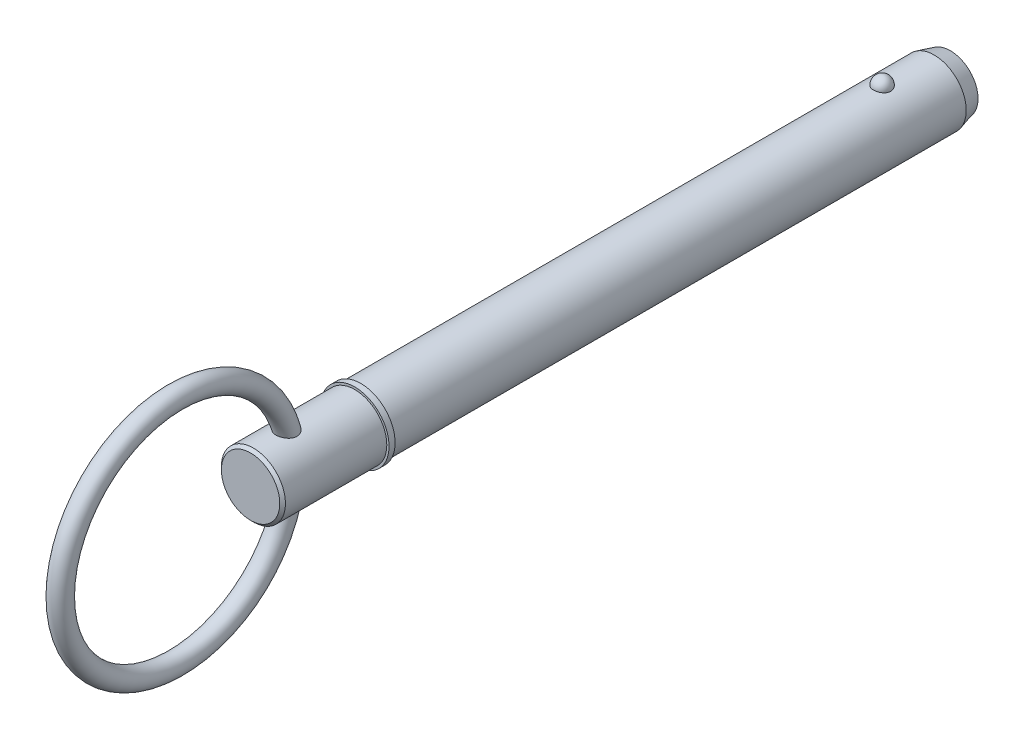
ISO-10303-21;
HEADER;
FILE_DESCRIPTION(('STEP AP214'),'2;1');
FILE_NAME('part.step','',(''),(''),'','','');
FILE_SCHEMA(('AUTOMOTIVE_DESIGN { 1 0 10303 214 1 1 1 1 }'));
ENDSEC;
DATA;
#1=APPLICATION_CONTEXT('core data for automotive mechanical design processes');
#2=APPLICATION_PROTOCOL_DEFINITION('international standard','automotive_design',2000,#1);
#3=PRODUCT_CONTEXT('',#1,'mechanical');
#4=PRODUCT('Part','Part','',(#3));
#5=PRODUCT_RELATED_PRODUCT_CATEGORY('part','',(#4));
#6=PRODUCT_DEFINITION_FORMATION('','',#4);
#7=PRODUCT_DEFINITION_CONTEXT('part definition',#1,'design');
#8=PRODUCT_DEFINITION('design','',#6,#7);
#9=PRODUCT_DEFINITION_SHAPE('','',#8);
#10=(LENGTH_UNIT() NAMED_UNIT(*) SI_UNIT(.MILLI.,.METRE.));
#11=(NAMED_UNIT(*) PLANE_ANGLE_UNIT() SI_UNIT($,.RADIAN.));
#12=(NAMED_UNIT(*) SI_UNIT($,.STERADIAN.) SOLID_ANGLE_UNIT());
#13=UNCERTAINTY_MEASURE_WITH_UNIT(LENGTH_MEASURE(1.E-05),#10,'distance_accuracy_value','');
#14=(GEOMETRIC_REPRESENTATION_CONTEXT(3) GLOBAL_UNCERTAINTY_ASSIGNED_CONTEXT((#13)) GLOBAL_UNIT_ASSIGNED_CONTEXT((#10,
#11,#12)) REPRESENTATION_CONTEXT('',''));
#15=CARTESIAN_POINT('',(0.,0.,0.));
#16=DIRECTION('',(0.,0.,1.));
#17=DIRECTION('',(1.,0.,0.));
#18=AXIS2_PLACEMENT_3D('',#15,#16,#17);
#19=CARTESIAN_POINT('',(0.,0.,127.));
#20=DIRECTION('',(0.,0.,-1.));
#21=DIRECTION('',(-1.,0.,0.));
#22=AXIS2_PLACEMENT_3D('',#19,#20,#21);
#23=CYLINDRICAL_SURFACE('',#22,7.94);
#24=CARTESIAN_POINT('',(2.13020349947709,7.64891057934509,-2.14999999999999));
#25=CARTESIAN_POINT('',(2.1302012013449,7.64891247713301,-2.02978166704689));
#26=CARTESIAN_POINT('',(2.12037546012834,7.65166842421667,-1.90953383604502));
#27=CARTESIAN_POINT('',(2.08130792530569,7.66238579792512,-1.67243962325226));
#28=CARTESIAN_POINT('',(2.05205785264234,7.67034944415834,-1.55559471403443));
#29=CARTESIAN_POINT('',(1.97489181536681,7.69057749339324,-1.32869361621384));
#30=CARTESIAN_POINT('',(1.92698409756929,7.70283999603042,-1.21863445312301));
#31=CARTESIAN_POINT('',(1.81370645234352,7.73029430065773,-1.00831338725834));
#32=CARTESIAN_POINT('',(1.74833715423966,7.7454859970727,-0.908051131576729));
#33=CARTESIAN_POINT('',(1.60144242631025,7.77718699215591,-0.719628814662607));
#34=CARTESIAN_POINT('',(1.51984382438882,7.7937020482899,-0.631526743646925));
#35=CARTESIAN_POINT('',(1.34279837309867,7.82614685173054,-0.470411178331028));
#36=CARTESIAN_POINT('',(1.24735148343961,7.84207659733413,-0.397397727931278));
#37=CARTESIAN_POINT('',(1.04544839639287,7.87153116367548,-0.268681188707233));
#38=CARTESIAN_POINT('',(0.939022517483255,7.88506234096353,-0.212932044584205));
#39=CARTESIAN_POINT('',(0.717931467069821,7.90825597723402,-0.120080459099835));
#40=CARTESIAN_POINT('',(0.603267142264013,7.9179188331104,-0.0829761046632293));
#41=CARTESIAN_POINT('',(0.371015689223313,7.93216561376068,-0.0289596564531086));
#42=CARTESIAN_POINT('',(0.253510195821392,7.93683225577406,-0.0117183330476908));
#43=CARTESIAN_POINT('',(0.0171784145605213,7.94086051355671,0.00318921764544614));
#44=CARTESIAN_POINT('',(-0.101647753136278,7.94022260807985,0.000857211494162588));
#45=CARTESIAN_POINT('',(-0.335567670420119,7.93375751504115,-0.023146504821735));
#46=CARTESIAN_POINT('',(-0.450690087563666,7.92799987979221,-0.0445590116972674));
#47=CARTESIAN_POINT('',(-0.675610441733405,7.91200792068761,-0.10576054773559));
#48=CARTESIAN_POINT('',(-0.785408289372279,7.90177352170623,-0.145549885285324));
#49=CARTESIAN_POINT('',(-0.9972706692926,7.87784802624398,-0.242675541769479));
#50=CARTESIAN_POINT('',(-1.0992893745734,7.86413823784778,-0.300107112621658));
#51=CARTESIAN_POINT('',(-1.29223659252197,7.83474718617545,-0.430887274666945));
#52=CARTESIAN_POINT('',(-1.38316404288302,7.81906573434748,-0.504237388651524));
#53=CARTESIAN_POINT('',(-1.55313516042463,7.78710451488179,-0.666358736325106));
#54=CARTESIAN_POINT('',(-1.63193689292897,7.77081906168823,-0.755382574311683));
#55=CARTESIAN_POINT('',(-1.77366356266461,7.73970270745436,-0.945507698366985));
#56=CARTESIAN_POINT('',(-1.83658745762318,7.72487190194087,-1.04660977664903));
#57=CARTESIAN_POINT('',(-1.94556640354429,7.6981535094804,-1.25927689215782));
#58=CARTESIAN_POINT('',(-1.99143480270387,7.6862989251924,-1.3709418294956));
#59=CARTESIAN_POINT('',(-2.06418311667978,7.66708387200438,-1.60066153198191));
#60=CARTESIAN_POINT('',(-2.0910635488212,7.65972328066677,-1.71871612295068));
#61=CARTESIAN_POINT('',(-2.12508507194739,7.65035479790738,-1.9573607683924));
#62=CARTESIAN_POINT('',(-2.13230490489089,7.64832555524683,-2.07793875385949));
#63=CARTESIAN_POINT('',(-2.12704767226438,7.64978921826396,-2.31862835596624));
#64=CARTESIAN_POINT('',(-2.1145710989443,7.6532819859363,-2.43873998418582));
#65=CARTESIAN_POINT('',(-2.07034166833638,7.66536368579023,-2.67451689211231));
#66=CARTESIAN_POINT('',(-2.03867758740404,7.67392914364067,-2.79020005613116));
#67=CARTESIAN_POINT('',(-1.95694065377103,7.69517736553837,-3.01446692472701));
#68=CARTESIAN_POINT('',(-1.90686710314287,7.70786028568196,-3.12305035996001));
#69=CARTESIAN_POINT('',(-1.78925555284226,7.73600831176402,-3.33065971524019));
#70=CARTESIAN_POINT('',(-1.72162904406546,7.75148739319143,-3.42963360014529));
#71=CARTESIAN_POINT('',(-1.57074739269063,7.78346215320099,-3.61466914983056));
#72=CARTESIAN_POINT('',(-1.48749169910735,7.79995786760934,-3.70073035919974));
#73=CARTESIAN_POINT('',(-1.30720250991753,7.83219119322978,-3.8578359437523));
#74=CARTESIAN_POINT('',(-1.2101234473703,7.84792605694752,-3.92882863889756));
#75=CARTESIAN_POINT('',(-1.00503150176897,7.87681523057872,-4.05342383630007));
#76=CARTESIAN_POINT('',(-0.897019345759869,7.88996971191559,-4.10702749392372));
#77=CARTESIAN_POINT('',(-0.674439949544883,7.91208451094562,-4.19477736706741));
#78=CARTESIAN_POINT('',(-0.55996501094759,7.92109245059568,-4.22914554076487));
#79=CARTESIAN_POINT('',(-0.326625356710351,7.93413878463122,-4.27838865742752));
#80=CARTESIAN_POINT('',(-0.20776113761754,7.93817773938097,-4.29326579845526));
#81=CARTESIAN_POINT('',(0.0287357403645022,7.94081322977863,-4.3030062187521));
#82=CARTESIAN_POINT('',(0.14635312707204,7.93950453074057,-4.29821797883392));
#83=CARTESIAN_POINT('',(0.379062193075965,7.93180098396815,-4.26955229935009));
#84=CARTESIAN_POINT('',(0.494153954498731,7.92540630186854,-4.24567548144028));
#85=CARTESIAN_POINT('',(0.718185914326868,7.90824874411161,-4.17962260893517));
#86=CARTESIAN_POINT('',(0.827145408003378,7.89750055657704,-4.13750805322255));
#87=CARTESIAN_POINT('',(1.03638036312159,7.87277755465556,-4.03615078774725));
#88=CARTESIAN_POINT('',(1.13665531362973,7.85880255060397,-3.97690707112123));
#89=CARTESIAN_POINT('',(1.32729731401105,7.82887859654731,-3.84189297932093));
#90=CARTESIAN_POINT('',(1.41749828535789,7.81290379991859,-3.76589388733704));
#91=CARTESIAN_POINT('',(1.58397257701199,7.78086330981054,-3.59992466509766));
#92=CARTESIAN_POINT('',(1.66024342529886,7.76479760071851,-3.50995206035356));
#93=CARTESIAN_POINT('',(1.79805631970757,7.73405928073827,-3.3168832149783));
#94=CARTESIAN_POINT('',(1.85933944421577,7.719413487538,-3.213597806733));
#95=CARTESIAN_POINT('',(1.96397499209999,7.69345992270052,-2.99796163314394));
#96=CARTESIAN_POINT('',(2.00733488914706,7.68215076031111,-2.88561466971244));
#97=CARTESIAN_POINT('',(2.07068045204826,7.66529896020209,-2.6699413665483));
#98=CARTESIAN_POINT('',(2.09296296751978,7.65919990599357,-2.56732606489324));
#99=CARTESIAN_POINT('',(2.12272535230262,7.65100492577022,-2.35981463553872));
#100=CARTESIAN_POINT('',(2.13020550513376,7.64890892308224,-2.25491855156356));
#101=CARTESIAN_POINT('',(2.13020349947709,7.64891057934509,-2.14999999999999));
#102=B_SPLINE_CURVE_WITH_KNOTS('',3,(#24,#25,#26,#27,#28,#29,#30,#31,#32,#33,#34,#35,#36,#37,
#38,#39,#40,#41,#42,#43,#44,#45,#46,#47,#48,#49,#50,#51,#52,#53,#54,#55,#56,#57,#58,#59,#60,#61,
#62,#63,#64,#65,#66,#67,#68,#69,#70,#71,#72,#73,#74,#75,#76,#77,#78,#79,#80,#81,#82,#83,#84,#85,
#86,#87,#88,#89,#90,#91,#92,#93,#94,#95,#96,#97,#98,#99,#100,#101),.UNSPECIFIED.,.T.,.F.,(4,2,2,
2,2,2,2,2,2,2,2,2,2,2,2,2,2,2,2,2,2,2,2,2,2,2,2,2,2,2,2,2,2,2,2,2,2,2,4),(0.,0.360277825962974,
0.720709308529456,1.0809816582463,1.44124102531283,1.80316307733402,2.16508618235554,
2.52603531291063,2.88694740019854,3.24178717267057,3.59659491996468,3.94665496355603,
4.29672088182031,4.64871108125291,5.0007349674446,5.3590619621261,5.71741247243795,
6.079576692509,6.44173104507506,6.80243279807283,7.16312553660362,7.52216203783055,
7.88121215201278,8.24210915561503,8.60301888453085,8.96514709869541,9.32725124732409,
9.68508606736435,10.0428805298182,10.3943622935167,10.7458326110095,11.0961268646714,
11.4464417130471,11.8018724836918,12.1573662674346,12.5186252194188,12.8797333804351,
13.1941658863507,13.5085923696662),.UNSPECIFIED.);
#103=CARTESIAN_POINT('',(2.13020349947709,7.64891057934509,-2.14999999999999));
#104=VERTEX_POINT('',#103);
#105=EDGE_CURVE('E103',#104,#104,#102,.T.);
#106=ORIENTED_EDGE('',*,*,#105,.T.);
#107=EDGE_LOOP('',(#106));
#108=FACE_BOUND('',#107,.T.);
#109=CARTESIAN_POINT('',(0.,0.,-15.05));
#110=DIRECTION('',(0.,0.,-1.));
#111=DIRECTION('',(-1.,0.,0.));
#112=AXIS2_PLACEMENT_3D('',#109,#110,#111);
#113=CIRCLE('',#112,7.94);
#114=CARTESIAN_POINT('',(-7.94,0.,-15.05));
#115=VERTEX_POINT('',#114);
#116=EDGE_CURVE('E111',#115,#115,#113,.F.);
#117=ORIENTED_EDGE('',*,*,#116,.T.);
#118=EDGE_LOOP('',(#117));
#119=FACE_BOUND('',#118,.T.);
#120=CARTESIAN_POINT('',(0.,0.,127.));
#121=DIRECTION('',(0.,0.,1.));
#122=DIRECTION('',(1.,0.,0.));
#123=AXIS2_PLACEMENT_3D('',#120,#121,#122);
#124=CIRCLE('',#123,7.94);
#125=CARTESIAN_POINT('',(7.94,0.,127.));
#126=VERTEX_POINT('',#125);
#127=EDGE_CURVE('E109',#126,#126,#124,.T.);
#128=ORIENTED_EDGE('',*,*,#127,.F.);
#129=EDGE_LOOP('',(#128));
#130=FACE_BOUND('',#129,.T.);
#131=ADVANCED_FACE('F39',(#108,#119,#130),#23,.T.);
#132=CARTESIAN_POINT('',(0.,0.,-19.05));
#133=DIRECTION('',(0.,0.,-1.));
#134=DIRECTION('',(-1.,0.,0.));
#135=AXIS2_PLACEMENT_3D('',#132,#133,#134);
#136=PLANE('',#135);
#137=CARTESIAN_POINT('',(0.,0.,-19.05));
#138=DIRECTION('',(0.,0.,-1.));
#139=DIRECTION('',(-1.,0.,0.));
#140=AXIS2_PLACEMENT_3D('',#137,#138,#139);
#141=CIRCLE('',#140,6.86820323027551);
#142=CARTESIAN_POINT('',(-6.86820323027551,0.,-19.05));
#143=VERTEX_POINT('',#142);
#144=EDGE_CURVE('E141',#143,#143,#141,.T.);
#145=ORIENTED_EDGE('',*,*,#144,.T.);
#146=EDGE_LOOP('',(#145));
#147=FACE_BOUND('',#146,.T.);
#148=ADVANCED_FACE('F89',(#147),#136,.T.);
#149=CARTESIAN_POINT('',(0.,0.,-19.05));
#150=DIRECTION('',(0.,0.,1.));
#151=DIRECTION('',(1.,0.,0.));
#152=AXIS2_PLACEMENT_3D('',#149,#150,#151);
#153=CONICAL_SURFACE('',#152,6.86820323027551,0.261799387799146);
#154=ORIENTED_EDGE('',*,*,#116,.F.);
#155=EDGE_LOOP('',(#154));
#156=FACE_BOUND('',#155,.T.);
#157=ORIENTED_EDGE('',*,*,#144,.F.);
#158=EDGE_LOOP('',(#157));
#159=FACE_BOUND('',#158,.T.);
#160=ADVANCED_FACE('F95',(#156,#159),#153,.T.);
#161=CARTESIAN_POINT('',(0.,7.94,-2.14999999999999));
#162=DIRECTION('',(0.,1.,0.));
#163=DIRECTION('',(0.,0.,-1.));
#164=AXIS2_PLACEMENT_3D('',#161,#162,#163);
#165=SPHERICAL_SURFACE('',#164,2.15);
#166=ORIENTED_EDGE('',*,*,#105,.F.);
#167=EDGE_LOOP('',(#166));
#168=FACE_BOUND('',#167,.T.);
#169=ADVANCED_FACE('F114',(#168),#165,.T.);
#170=CARTESIAN_POINT('',(0.,0.,127.));
#171=DIRECTION('',(0.,0.,-1.));
#172=DIRECTION('',(-1.,0.,0.));
#173=AXIS2_PLACEMENT_3D('',#170,#171,#172);
#174=PLANE('',#173);
#175=ORIENTED_EDGE('',*,*,#127,.T.);
#176=EDGE_LOOP('',(#175));
#177=FACE_BOUND('',#176,.T.);
#178=CARTESIAN_POINT('',(0.,0.,127.));
#179=DIRECTION('',(0.,0.,-1.));
#180=DIRECTION('',(-1.,0.,0.));
#181=AXIS2_PLACEMENT_3D('',#178,#179,#180);
#182=CIRCLE('',#181,8.5);
#183=CARTESIAN_POINT('',(-8.5,0.,127.));
#184=VERTEX_POINT('',#183);
#185=EDGE_CURVE('E110',#184,#184,#182,.T.);
#186=ORIENTED_EDGE('',*,*,#185,.T.);
#187=EDGE_LOOP('',(#186));
#188=FACE_BOUND('',#187,.T.);
#189=ADVANCED_FACE('F118',(#177,#188),#174,.T.);
#190=CARTESIAN_POINT('',(0.,0.,33.7287874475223));
#191=DIRECTION('',(0.,0.,-1.));
#192=DIRECTION('',(-1.,0.,0.));
#193=AXIS2_PLACEMENT_3D('',#190,#191,#192);
#194=CYLINDRICAL_SURFACE('',#193,8.5);
#195=CARTESIAN_POINT('',(0.,0.,128.5));
#196=DIRECTION('',(0.,0.,-1.));
#197=DIRECTION('',(-1.,0.,0.));
#198=AXIS2_PLACEMENT_3D('',#195,#196,#197);
#199=CIRCLE('',#198,8.5);
#200=CARTESIAN_POINT('',(-8.5,0.,128.5));
#201=VERTEX_POINT('',#200);
#202=EDGE_CURVE('E135',#201,#201,#199,.T.);
#203=ORIENTED_EDGE('',*,*,#202,.T.);
#204=EDGE_LOOP('',(#203));
#205=FACE_BOUND('',#204,.T.);
#206=ORIENTED_EDGE('',*,*,#185,.F.);
#207=EDGE_LOOP('',(#206));
#208=FACE_BOUND('',#207,.T.);
#209=ADVANCED_FACE('F122',(#205,#208),#194,.T.);
#210=CARTESIAN_POINT('',(0.,8.5,128.5));
#211=DIRECTION('',(0.,0.,1.));
#212=DIRECTION('',(1.,0.,0.));
#213=AXIS2_PLACEMENT_3D('',#210,#211,#212);
#214=PLANE('',#213);
#215=CARTESIAN_POINT('',(0.,0.,128.5));
#216=DIRECTION('',(0.,0.,1.));
#217=DIRECTION('',(1.,0.,0.));
#218=AXIS2_PLACEMENT_3D('',#215,#216,#217);
#219=CIRCLE('',#218,7.94);
#220=CARTESIAN_POINT('',(7.94,0.,128.5));
#221=VERTEX_POINT('',#220);
#222=EDGE_CURVE('E113',#221,#221,#219,.T.);
#223=ORIENTED_EDGE('',*,*,#222,.F.);
#224=EDGE_LOOP('',(#223));
#225=FACE_BOUND('',#224,.T.);
#226=ORIENTED_EDGE('',*,*,#202,.F.);
#227=EDGE_LOOP('',(#226));
#228=FACE_BOUND('',#227,.T.);
#229=ADVANCED_FACE('F86',(#225,#228),#214,.T.);
#230=CARTESIAN_POINT('',(0.,0.,154.31));
#231=DIRECTION('',(0.,0.,-1.));
#232=DIRECTION('',(-1.,0.,0.));
#233=AXIS2_PLACEMENT_3D('',#230,#231,#232);
#234=CYLINDRICAL_SURFACE('',#233,7.94);
#235=CARTESIAN_POINT('',(-1.15544091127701,-7.85547938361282,143.111910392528));
#236=CARTESIAN_POINT('',(-1.03089695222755,-7.87379554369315,143.049615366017));
#237=CARTESIAN_POINT('',(-0.900845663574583,-7.8898743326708,142.997593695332));
#238=CARTESIAN_POINT('',(-0.633417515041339,-7.91583465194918,142.915265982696));
#239=CARTESIAN_POINT('',(-0.496037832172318,-7.92571377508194,142.884968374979));
#240=CARTESIAN_POINT('',(-0.217881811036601,-7.93823020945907,142.846773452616));
#241=CARTESIAN_POINT('',(-0.0771057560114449,-7.94086812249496,142.838874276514));
#242=CARTESIAN_POINT('',(0.203828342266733,-7.93862624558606,142.845648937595));
#243=CARTESIAN_POINT('',(0.343986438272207,-7.93374711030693,142.860320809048));
#244=CARTESIAN_POINT('',(0.619544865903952,-7.9169944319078,142.911877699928));
#245=CARTESIAN_POINT('',(0.754950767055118,-7.9051293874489,142.948735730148));
#246=CARTESIAN_POINT('',(1.01737529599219,-7.8756583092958,143.043842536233));
#247=CARTESIAN_POINT('',(1.14439334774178,-7.85805188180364,143.102092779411));
#248=CARTESIAN_POINT('',(1.38668443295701,-7.81893907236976,143.238842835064));
#249=CARTESIAN_POINT('',(1.50193494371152,-7.79742542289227,143.317380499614));
#250=CARTESIAN_POINT('',(1.71711272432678,-7.75288428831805,143.492872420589));
#251=CARTESIAN_POINT('',(1.81704089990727,-7.72985689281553,143.589825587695));
#252=CARTESIAN_POINT('',(1.99787261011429,-7.68509802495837,143.79887149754));
#253=CARTESIAN_POINT('',(2.07893183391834,-7.66335713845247,143.910827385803));
#254=CARTESIAN_POINT('',(2.2207658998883,-7.62346723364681,144.147480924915));
#255=CARTESIAN_POINT('',(2.28154607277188,-7.6053172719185,144.272175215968));
#256=CARTESIAN_POINT('',(2.38011540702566,-7.57504217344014,144.527618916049));
#257=CARTESIAN_POINT('',(2.41840843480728,-7.56278621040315,144.658158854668));
#258=CARTESIAN_POINT('',(2.47363993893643,-7.54490265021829,144.924095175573));
#259=CARTESIAN_POINT('',(2.49057788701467,-7.53927521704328,145.059491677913));
#260=CARTESIAN_POINT('',(2.50351014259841,-7.53499042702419,145.33242871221));
#261=CARTESIAN_POINT('',(2.49933630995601,-7.53638902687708,145.469977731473));
#262=CARTESIAN_POINT('',(2.47072547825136,-7.54581524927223,145.742698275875));
#263=CARTESIAN_POINT('',(2.44628184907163,-7.55384504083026,145.877869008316));
#264=CARTESIAN_POINT('',(2.37589315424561,-7.57629160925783,146.153085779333));
#265=CARTESIAN_POINT('',(2.32844094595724,-7.5911515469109,146.29270896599));
#266=CARTESIAN_POINT('',(2.21332780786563,-7.62550828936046,146.562781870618));
#267=CARTESIAN_POINT('',(2.14565489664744,-7.64500784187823,146.693226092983));
#268=CARTESIAN_POINT('',(1.98438755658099,-7.68852412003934,146.953702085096));
#269=CARTESIAN_POINT('',(1.88896913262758,-7.71279219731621,147.082569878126));
#270=CARTESIAN_POINT('',(1.67743245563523,-7.7615471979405,147.322112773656));
#271=CARTESIAN_POINT('',(1.56130644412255,-7.78603420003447,147.432781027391));
#272=CARTESIAN_POINT('',(1.31168281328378,-7.83191501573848,147.630100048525));
#273=CARTESIAN_POINT('',(1.1784163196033,-7.85334315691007,147.717029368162));
#274=CARTESIAN_POINT('',(0.967442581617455,-7.88116219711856,147.826657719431));
#275=CARTESIAN_POINT('',(0.895283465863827,-7.88971376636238,147.859736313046));
#276=CARTESIAN_POINT('',(0.747777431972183,-7.90505596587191,147.918400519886));
#277=CARTESIAN_POINT('',(0.672431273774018,-7.91184701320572,147.943987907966));
#278=CARTESIAN_POINT('',(0.53057561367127,-7.92252382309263,147.983912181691));
#279=CARTESIAN_POINT('',(0.464394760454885,-7.92668987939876,147.999349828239));
#280=CARTESIAN_POINT('',(0.330815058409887,-7.9333870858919,148.024069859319));
#281=CARTESIAN_POINT('',(0.263416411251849,-7.93591850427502,148.03335325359));
#282=CARTESIAN_POINT('',(0.128041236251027,-7.93925585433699,148.045577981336));
#283=CARTESIAN_POINT('',(0.0600650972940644,-7.94006286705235,148.048523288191));
#284=CARTESIAN_POINT('',(-0.0758408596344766,-7.93992929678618,148.048033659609));
#285=CARTESIAN_POINT('',(-0.143770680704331,-7.93898884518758,148.044599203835));
#286=CARTESIAN_POINT('',(-0.330023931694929,-7.93402174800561,148.026406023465));
#287=CARTESIAN_POINT('',(-0.447720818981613,-7.92820264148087,148.005060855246));
#288=CARTESIAN_POINT('',(-0.677833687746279,-7.91185818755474,147.944093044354));
#289=CARTESIAN_POINT('',(-0.790248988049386,-7.90133223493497,147.904468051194));
#290=CARTESIAN_POINT('',(-1.01082100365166,-7.87620111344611,147.807436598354));
#291=CARTESIAN_POINT('',(-1.1187367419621,-7.86147932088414,147.749515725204));
#292=CARTESIAN_POINT('',(-1.32464461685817,-7.8294189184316,147.618755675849));
#293=CARTESIAN_POINT('',(-1.42263264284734,-7.81207923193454,147.545910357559));
#294=CARTESIAN_POINT('',(-1.62038324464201,-7.77363945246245,147.376536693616));
#295=CARTESIAN_POINT('',(-1.7184938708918,-7.75235190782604,147.278123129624));
#296=CARTESIAN_POINT('',(-1.89908721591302,-7.71010284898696,147.067783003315));
#297=CARTESIAN_POINT('',(-1.9815587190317,-7.68914157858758,146.955846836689));
#298=CARTESIAN_POINT('',(-2.13974270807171,-7.64674394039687,146.705108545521));
#299=CARTESIAN_POINT('',(-2.21304020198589,-7.62562536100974,146.564719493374));
#300=CARTESIAN_POINT('',(-2.33615659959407,-7.58881542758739,146.273266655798));
#301=CARTESIAN_POINT('',(-2.38596943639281,-7.57312547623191,146.122200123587));
#302=CARTESIAN_POINT('',(-2.46059473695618,-7.54921618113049,145.810492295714));
#303=CARTESIAN_POINT('',(-2.48494918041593,-7.54113395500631,145.649728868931));
#304=CARTESIAN_POINT('',(-2.50480773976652,-7.53456588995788,145.326244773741));
#305=CARTESIAN_POINT('',(-2.50033692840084,-7.53607171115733,145.163525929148));
#306=CARTESIAN_POINT('',(-2.46306926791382,-7.54832452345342,144.857165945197));
#307=CARTESIAN_POINT('',(-2.4329569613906,-7.55819528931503,144.713162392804));
#308=CARTESIAN_POINT('',(-2.34806892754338,-7.58499431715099,144.433304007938));
#309=CARTESIAN_POINT('',(-2.29330013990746,-7.60192059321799,144.297446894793));
#310=CARTESIAN_POINT('',(-2.16523724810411,-7.63933506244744,144.04765733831));
#311=CARTESIAN_POINT('',(-2.09353456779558,-7.65948502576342,143.932853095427));
#312=CARTESIAN_POINT('',(-1.93200913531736,-7.7018104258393,143.717268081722));
#313=CARTESIAN_POINT('',(-1.842192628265,-7.72398516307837,143.616482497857));
#314=CARTESIAN_POINT('',(-1.65746337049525,-7.76558957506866,143.44131484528));
#315=CARTESIAN_POINT('',(-1.56413624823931,-7.78505810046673,143.365259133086));
#316=CARTESIAN_POINT('',(-1.36706423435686,-7.82207051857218,143.22753576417));
#317=CARTESIAN_POINT('',(-1.26331856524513,-7.83961426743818,143.165869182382));
#318=CARTESIAN_POINT('',(-1.15544091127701,-7.85547938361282,143.111910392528));
#319=B_SPLINE_CURVE_WITH_KNOTS('',3,(#235,#236,#237,#238,#239,#240,#241,#242,#243,#244,#245,
#246,#247,#248,#249,#250,#251,#252,#253,#254,#255,#256,#257,#258,#259,#260,#261,#262,#263,#264,
#265,#266,#267,#268,#269,#270,#271,#272,#273,#274,#275,#276,#277,#278,#279,#280,#281,#282,#283,
#284,#285,#286,#287,#288,#289,#290,#291,#292,#293,#294,#295,#296,#297,#298,#299,#300,#301,#302,
#303,#304,#305,#306,#307,#308,#309,#310,#311,#312,#313,#314,#315,#316,#317,#318),.UNSPECIFIED.,
.T.,.F.,(4,2,2,2,2,2,2,2,2,2,2,2,2,2,2,2,2,2,2,2,2,2,2,2,2,2,2,2,2,2,2,2,2,2,2,2,2,2,2,2,2,4),
(0.,0.420927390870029,0.842018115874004,1.26307384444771,1.68409290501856,2.10460083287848,
2.52513760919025,2.94646475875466,3.36776699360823,3.7854589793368,4.20304108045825,
4.61086922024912,5.01870744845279,5.42979890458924,5.84102487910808,6.28383316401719,
6.72690434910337,7.21113455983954,7.6955465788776,8.17400305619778,8.41316278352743,
8.65226580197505,8.85622998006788,9.06016068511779,9.26396350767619,9.4677510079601,
9.8252104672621,10.1827159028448,10.5513335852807,10.9201032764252,11.3402098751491,
11.7606166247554,12.2377707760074,12.715048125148,13.2007716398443,13.6860727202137,
14.1260485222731,14.5659005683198,14.9745225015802,15.3830037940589,15.7475760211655,
16.1121754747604),.UNSPECIFIED.);
#320=CARTESIAN_POINT('',(-1.15544091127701,-7.85547938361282,143.111910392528));
#321=VERTEX_POINT('',#320);
#322=EDGE_CURVE('E10',#321,#321,#319,.T.);
#323=ORIENTED_EDGE('',*,*,#322,.F.);
#324=EDGE_LOOP('',(#323));
#325=FACE_BOUND('',#324,.T.);
#326=CARTESIAN_POINT('',(-1.15544091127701,7.85547938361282,143.111910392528));
#327=CARTESIAN_POINT('',(-1.278579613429,7.83736699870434,143.173507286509));
#328=CARTESIAN_POINT('',(-1.39638360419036,7.8170599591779,143.245172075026));
#329=CARTESIAN_POINT('',(-1.61803025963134,7.77421032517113,143.40708252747));
#330=CARTESIAN_POINT('',(-1.72186951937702,7.7516671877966,143.497332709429));
#331=CARTESIAN_POINT('',(-1.91269683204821,7.70680387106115,143.694395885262));
#332=CARTESIAN_POINT('',(-1.99967065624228,7.68448389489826,143.801222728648));
#333=CARTESIAN_POINT('',(-2.15412555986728,7.64262858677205,144.028607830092));
#334=CARTESIAN_POINT('',(-2.22161184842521,7.62309251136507,144.149162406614));
#335=CARTESIAN_POINT('',(-2.3342927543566,7.5893410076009,144.398377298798));
#336=CARTESIAN_POINT('',(-2.3798562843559,7.57503857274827,144.526859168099));
#337=CARTESIAN_POINT('',(-2.44955571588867,7.55278941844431,144.790011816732));
#338=CARTESIAN_POINT('',(-2.47369226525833,7.544842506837,144.92468240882));
#339=CARTESIAN_POINT('',(-2.50059611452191,7.53596831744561,145.196137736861));
#340=CARTESIAN_POINT('',(-2.50339277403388,7.53503139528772,145.332919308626));
#341=CARTESIAN_POINT('',(-2.48855779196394,7.53994222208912,145.605224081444));
#342=CARTESIAN_POINT('',(-2.47092012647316,7.54579197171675,145.74074689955));
#343=CARTESIAN_POINT('',(-2.41469361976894,7.56397908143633,146.016293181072));
#344=CARTESIAN_POINT('',(-2.37479606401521,7.57671999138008,146.15602135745));
#345=CARTESIAN_POINT('',(-2.27489955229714,7.60730881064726,146.427515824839));
#346=CARTESIAN_POINT('',(-2.2148900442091,7.6251594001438,146.559277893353));
#347=CARTESIAN_POINT('',(-2.06943931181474,7.66598084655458,146.82452508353));
#348=CARTESIAN_POINT('',(-1.98208275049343,7.68928197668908,146.956914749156));
#349=CARTESIAN_POINT('',(-1.78658869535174,7.73704343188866,147.205235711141));
#350=CARTESIAN_POINT('',(-1.67843905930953,7.76150442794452,147.321157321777));
#351=CARTESIAN_POINT('',(-1.44142605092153,7.80900750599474,147.533699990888));
#352=CARTESIAN_POINT('',(-1.31231821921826,7.83202775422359,147.630058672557));
#353=CARTESIAN_POINT('',(-1.10627655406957,7.86286215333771,147.754614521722));
#354=CARTESIAN_POINT('',(-1.03552563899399,7.87252500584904,147.792805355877));
#355=CARTESIAN_POINT('',(-0.890375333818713,7.89025728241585,147.861885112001));
#356=CARTESIAN_POINT('',(-0.815978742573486,7.89832790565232,147.892779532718));
#357=CARTESIAN_POINT('',(-0.674180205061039,7.91160332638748,147.943082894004));
#358=CARTESIAN_POINT('',(-0.607145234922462,7.91704543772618,147.963468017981));
#359=CARTESIAN_POINT('',(-0.471385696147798,7.92628663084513,147.997876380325));
#360=CARTESIAN_POINT('',(-0.402662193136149,7.93008672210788,148.011903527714));
#361=CARTESIAN_POINT('',(-0.264153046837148,7.9359070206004,148.033322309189));
#362=CARTESIAN_POINT('',(-0.194368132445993,7.9379283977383,148.040718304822));
#363=CARTESIAN_POINT('',(-0.0544054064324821,7.94012285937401,148.048743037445));
#364=CARTESIAN_POINT('',(0.0157723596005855,7.94029615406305,148.049372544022));
#365=CARTESIAN_POINT('',(0.206295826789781,7.93822912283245,148.041825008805));
#366=CARTESIAN_POINT('',(0.326425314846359,7.93416340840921,148.026989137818));
#367=CARTESIAN_POINT('',(0.562310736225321,7.92094769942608,147.978077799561));
#368=CARTESIAN_POINT('',(0.67806631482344,7.91179729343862,147.94400077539));
#369=CARTESIAN_POINT('',(0.903029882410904,7.88929555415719,147.858269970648));
#370=CARTESIAN_POINT('',(1.01220356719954,7.87592415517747,147.806532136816));
#371=CARTESIAN_POINT('',(1.22142047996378,7.84620431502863,147.687793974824));
#372=CARTESIAN_POINT('',(1.32146048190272,7.82985482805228,147.620788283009));
#373=CARTESIAN_POINT('',(1.52328754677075,7.7932678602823,147.464309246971));
#374=CARTESIAN_POINT('',(1.6236508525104,7.77280069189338,147.373056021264));
#375=CARTESIAN_POINT('',(1.80985117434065,7.73156849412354,147.176815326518));
#376=CARTESIAN_POINT('',(1.895678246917,7.71080327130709,147.07181854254));
#377=CARTESIAN_POINT('',(2.06302404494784,7.66785771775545,146.834543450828));
#378=CARTESIAN_POINT('',(2.1421317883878,7.64590590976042,146.700514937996));
#379=CARTESIAN_POINT('',(2.27825755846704,7.60645646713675,146.420994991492));
#380=CARTESIAN_POINT('',(2.33526577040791,7.58896081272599,146.275498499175));
#381=CARTESIAN_POINT('',(2.42707573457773,7.56011538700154,145.970242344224));
#382=CARTESIAN_POINT('',(2.4608459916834,7.54905411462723,145.810140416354));
#383=CARTESIAN_POINT('',(2.49980168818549,7.53624914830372,145.486129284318));
#384=CARTESIAN_POINT('',(2.50500938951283,7.5344981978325,145.322223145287));
#385=CARTESIAN_POINT('',(2.48594104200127,7.54080673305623,145.009976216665));
#386=CARTESIAN_POINT('',(2.46407777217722,7.54806351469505,144.861473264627));
#387=CARTESIAN_POINT('',(2.3945479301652,7.57040718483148,144.571258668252));
#388=CARTESIAN_POINT('',(2.34689355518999,7.58549037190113,144.429543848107));
#389=CARTESIAN_POINT('',(2.2318274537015,7.62009243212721,144.169141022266));
#390=CARTESIAN_POINT('',(2.16637710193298,7.63914093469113,144.049517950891));
#391=CARTESIAN_POINT('',(2.01638736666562,7.68009146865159,143.82346099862));
#392=CARTESIAN_POINT('',(1.93184850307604,7.7019934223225,143.717026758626));
#393=CARTESIAN_POINT('',(1.746642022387,7.74608439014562,143.52066977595));
#394=CARTESIAN_POINT('',(1.646079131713,7.76827073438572,143.43064744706));
#395=CARTESIAN_POINT('',(1.43119791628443,7.81071401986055,143.268308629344));
#396=CARTESIAN_POINT('',(1.31687846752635,7.83097080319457,143.195993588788));
#397=CARTESIAN_POINT('',(1.07477437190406,7.86789551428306,143.069149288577));
#398=CARTESIAN_POINT('',(0.946739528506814,7.88446964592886,143.015069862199));
#399=CARTESIAN_POINT('',(0.683029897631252,7.91167708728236,142.928213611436));
#400=CARTESIAN_POINT('',(0.54735441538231,7.92230985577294,142.895438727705));
#401=CARTESIAN_POINT('',(0.271066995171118,7.93658630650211,142.851730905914));
#402=CARTESIAN_POINT('',(0.130424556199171,7.94017418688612,142.840972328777));
#403=CARTESIAN_POINT('',(-0.150736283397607,7.93981282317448,142.842062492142));
#404=CARTESIAN_POINT('',(-0.291254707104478,7.93586558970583,142.853905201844));
#405=CARTESIAN_POINT('',(-0.556023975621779,7.92151946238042,142.897891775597));
#406=CARTESIAN_POINT('',(-0.68062174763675,7.91171585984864,142.928166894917));
#407=CARTESIAN_POINT('',(-0.923476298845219,7.88705844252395,143.006736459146));
#408=CARTESIAN_POINT('',(-1.04173303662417,7.87220459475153,143.055031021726));
#409=CARTESIAN_POINT('',(-1.15544091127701,7.85547938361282,143.111910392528));
#410=B_SPLINE_CURVE_WITH_KNOTS('',3,(#326,#327,#328,#329,#330,#331,#332,#333,#334,#335,#336,
#337,#338,#339,#340,#341,#342,#343,#344,#345,#346,#347,#348,#349,#350,#351,#352,#353,#354,#355,
#356,#357,#358,#359,#360,#361,#362,#363,#364,#365,#366,#367,#368,#369,#370,#371,#372,#373,#374,
#375,#376,#377,#378,#379,#380,#381,#382,#383,#384,#385,#386,#387,#388,#389,#390,#391,#392,#393,
#394,#395,#396,#397,#398,#399,#400,#401,#402,#403,#404,#405,#406,#407,#408,#409),.UNSPECIFIED.,
.T.,.F.,(4,2,2,2,2,2,2,2,2,2,2,2,2,2,2,2,2,2,2,2,2,2,2,2,2,2,2,2,2,2,2,2,2,2,2,2,2,2,2,2,2,4),
(0.,0.416167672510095,0.832436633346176,1.24905527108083,1.66556244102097,2.07479168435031,
2.48400855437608,2.89266231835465,3.30143658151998,3.73725068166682,4.17329379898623,
4.65204873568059,5.13108409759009,5.61617224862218,5.85876072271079,6.10116578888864,
6.31168904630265,6.52208269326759,6.73233785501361,6.9425691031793,7.30398888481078,
7.66543791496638,8.02863174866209,8.39195337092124,8.80190673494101,9.21213940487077,
9.68159903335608,10.1512669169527,10.6406305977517,11.1296128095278,11.5779838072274,
12.0261429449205,12.4372146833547,12.8482752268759,13.256751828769,13.6652618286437,
14.0832160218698,14.5012082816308,14.9224982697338,15.3436758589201,15.72796797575,
16.1122626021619),.UNSPECIFIED.);
#411=CARTESIAN_POINT('',(-1.15544091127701,7.85547938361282,143.111910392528));
#412=VERTEX_POINT('',#411);
#413=EDGE_CURVE('E51',#412,#412,#410,.T.);
#414=ORIENTED_EDGE('',*,*,#413,.F.);
#415=EDGE_LOOP('',(#414));
#416=FACE_BOUND('',#415,.T.);
#417=CARTESIAN_POINT('',(0.,0.,153.61));
#418=DIRECTION('',(0.,0.,-1.));
#419=DIRECTION('',(-1.,0.,0.));
#420=AXIS2_PLACEMENT_3D('',#417,#418,#419);
#421=CIRCLE('',#420,7.94);
#422=CARTESIAN_POINT('',(-7.93999999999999,0.,153.61));
#423=VERTEX_POINT('',#422);
#424=EDGE_CURVE('E65',#423,#423,#421,.T.);
#425=ORIENTED_EDGE('',*,*,#424,.T.);
#426=EDGE_LOOP('',(#425));
#427=FACE_BOUND('',#426,.T.);
#428=ORIENTED_EDGE('',*,*,#222,.T.);
#429=EDGE_LOOP('',(#428));
#430=FACE_BOUND('',#429,.T.);
#431=ADVANCED_FACE('F70',(#325,#416,#427,#430),#234,.T.);
#432=CARTESIAN_POINT('',(0.,0.,154.31));
#433=DIRECTION('',(0.,0.,-1.));
#434=DIRECTION('',(-1.,0.,0.));
#435=AXIS2_PLACEMENT_3D('',#432,#433,#434);
#436=PLANE('',#435);
#437=CARTESIAN_POINT('',(0.,0.,154.31));
#438=DIRECTION('',(0.,0.,-1.));
#439=DIRECTION('',(-1.,0.,0.));
#440=AXIS2_PLACEMENT_3D('',#437,#438,#439);
#441=CIRCLE('',#440,7.24000000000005);
#442=CARTESIAN_POINT('',(-7.24000000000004,0.,154.31));
#443=VERTEX_POINT('',#442);
#444=EDGE_CURVE('E58',#443,#443,#441,.F.);
#445=ORIENTED_EDGE('',*,*,#444,.T.);
#446=EDGE_LOOP('',(#445));
#447=FACE_BOUND('',#446,.T.);
#448=ADVANCED_FACE('F77',(#447),#436,.F.);
#449=CARTESIAN_POINT('',(0.,0.,153.61));
#450=DIRECTION('',(0.,0.,-1.));
#451=DIRECTION('',(-1.,0.,0.));
#452=AXIS2_PLACEMENT_3D('',#449,#450,#451);
#453=CONICAL_SURFACE('',#452,7.94,0.785398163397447);
#454=CARTESIAN_POINT('',(-7.24000000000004,0.,154.31));
#455=CARTESIAN_POINT('',(-7.2472916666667,0.,154.302708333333));
#456=CARTESIAN_POINT('',(-7.25458333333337,0.,154.295416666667));
#457=CARTESIAN_POINT('',(-7.2691666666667,0.,154.280833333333));
#458=CARTESIAN_POINT('',(-7.27645833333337,0.,154.273541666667));
#459=CARTESIAN_POINT('',(-7.2910416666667,0.,154.258958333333));
#460=CARTESIAN_POINT('',(-7.29833333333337,0.,154.251666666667));
#461=CARTESIAN_POINT('',(-7.3129166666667,0.,154.237083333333));
#462=CARTESIAN_POINT('',(-7.32020833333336,0.,154.229791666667));
#463=CARTESIAN_POINT('',(-7.3347916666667,0.,154.215208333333));
#464=CARTESIAN_POINT('',(-7.34208333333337,0.,154.207916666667));
#465=CARTESIAN_POINT('',(-7.3566666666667,0.,154.193333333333));
#466=CARTESIAN_POINT('',(-7.36395833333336,0.,154.186041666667));
#467=CARTESIAN_POINT('',(-7.37854166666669,0.,154.171458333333));
#468=CARTESIAN_POINT('',(-7.38583333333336,0.,154.164166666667));
#469=CARTESIAN_POINT('',(-7.40041666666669,0.,154.149583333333));
#470=CARTESIAN_POINT('',(-7.40770833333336,0.,154.142291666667));
#471=CARTESIAN_POINT('',(-7.42229166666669,0.,154.127708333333));
#472=CARTESIAN_POINT('',(-7.42958333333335,0.,154.120416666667));
#473=CARTESIAN_POINT('',(-7.44416666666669,0.,154.105833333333));
#474=CARTESIAN_POINT('',(-7.45145833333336,0.,154.098541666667));
#475=CARTESIAN_POINT('',(-7.46604166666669,0.,154.083958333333));
#476=CARTESIAN_POINT('',(-7.47333333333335,0.,154.076666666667));
#477=CARTESIAN_POINT('',(-7.48791666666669,0.,154.062083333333));
#478=CARTESIAN_POINT('',(-7.49520833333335,0.,154.054791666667));
#479=CARTESIAN_POINT('',(-7.50979166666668,0.,154.040208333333));
#480=CARTESIAN_POINT('',(-7.51708333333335,0.,154.032916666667));
#481=CARTESIAN_POINT('',(-7.53166666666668,0.,154.018333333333));
#482=CARTESIAN_POINT('',(-7.53895833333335,0.,154.011041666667));
#483=CARTESIAN_POINT('',(-7.55354166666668,0.,153.996458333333));
#484=CARTESIAN_POINT('',(-7.56083333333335,0.,153.989166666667));
#485=CARTESIAN_POINT('',(-7.57541666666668,0.,153.974583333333));
#486=CARTESIAN_POINT('',(-7.58270833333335,0.,153.967291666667));
#487=CARTESIAN_POINT('',(-7.59729166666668,0.,153.952708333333));
#488=CARTESIAN_POINT('',(-7.60458333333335,0.,153.945416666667));
#489=CARTESIAN_POINT('',(-7.61916666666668,0.,153.930833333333));
#490=CARTESIAN_POINT('',(-7.62645833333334,0.,153.923541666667));
#491=CARTESIAN_POINT('',(-7.64104166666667,0.,153.908958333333));
#492=CARTESIAN_POINT('',(-7.64833333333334,0.,153.901666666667));
#493=CARTESIAN_POINT('',(-7.66291666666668,0.,153.887083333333));
#494=CARTESIAN_POINT('',(-7.67020833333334,0.,153.879791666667));
#495=CARTESIAN_POINT('',(-7.68479166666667,0.,153.865208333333));
#496=CARTESIAN_POINT('',(-7.69208333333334,0.,153.857916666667));
#497=CARTESIAN_POINT('',(-7.70666666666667,0.,153.843333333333));
#498=CARTESIAN_POINT('',(-7.71395833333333,0.,153.836041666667));
#499=CARTESIAN_POINT('',(-7.72854166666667,0.,153.821458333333));
#500=CARTESIAN_POINT('',(-7.73583333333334,0.,153.814166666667));
#501=CARTESIAN_POINT('',(-7.75041666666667,0.,153.799583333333));
#502=CARTESIAN_POINT('',(-7.75770833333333,0.,153.792291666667));
#503=CARTESIAN_POINT('',(-7.77229166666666,0.,153.777708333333));
#504=CARTESIAN_POINT('',(-7.77958333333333,0.,153.770416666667));
#505=CARTESIAN_POINT('',(-7.79416666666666,0.,153.755833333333));
#506=CARTESIAN_POINT('',(-7.80145833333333,0.,153.748541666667));
#507=CARTESIAN_POINT('',(-7.81604166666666,0.,153.733958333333));
#508=CARTESIAN_POINT('',(-7.82333333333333,0.,153.726666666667));
#509=CARTESIAN_POINT('',(-7.83791666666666,0.,153.712083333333));
#510=CARTESIAN_POINT('',(-7.84520833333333,0.,153.704791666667));
#511=CARTESIAN_POINT('',(-7.85979166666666,0.,153.690208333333));
#512=CARTESIAN_POINT('',(-7.86708333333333,0.,153.682916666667));
#513=CARTESIAN_POINT('',(-7.88166666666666,0.,153.668333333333));
#514=CARTESIAN_POINT('',(-7.88895833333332,0.,153.661041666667));
#515=CARTESIAN_POINT('',(-7.90354166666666,0.,153.646458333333));
#516=CARTESIAN_POINT('',(-7.91083333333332,0.,153.639166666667));
#517=CARTESIAN_POINT('',(-7.92541666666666,0.,153.624583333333));
#518=CARTESIAN_POINT('',(-7.93270833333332,0.,153.617291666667));
#519=CARTESIAN_POINT('',(-7.93999999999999,0.,153.61));
#520=B_SPLINE_CURVE_WITH_KNOTS('',3,(#454,#455,#456,#457,#458,#459,#460,#461,#462,#463,#464,
#465,#466,#467,#468,#469,#470,#471,#472,#473,#474,#475,#476,#477,#478,#479,#480,#481,#482,#483,
#484,#485,#486,#487,#488,#489,#490,#491,#492,#493,#494,#495,#496,#497,#498,#499,#500,#501,#502,
#503,#504,#505,#506,#507,#508,#509,#510,#511,#512,#513,#514,#515,#516,#517,#518,#519),
.UNSPECIFIED.,.F.,.F.,(4,2,2,2,2,2,2,2,2,2,2,2,2,2,2,2,2,2,2,2,2,2,2,2,2,2,2,2,2,2,2,2,4),(0.,
0.0309359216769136,0.0618718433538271,0.0928077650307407,0.123743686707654,0.154679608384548,
0.185615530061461,0.216551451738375,0.247487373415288,0.278423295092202,0.309359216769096,
0.340295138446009,0.371231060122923,0.402166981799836,0.43310290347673,0.464038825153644,
0.494974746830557,0.525910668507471,0.556846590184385,0.587782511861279,0.618718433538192,
0.649654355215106,0.680590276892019,0.711526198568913,0.742462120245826,0.77339804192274,
0.804333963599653,0.835269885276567,0.866205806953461,0.897141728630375,0.928077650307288,
0.959013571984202,0.989949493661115),.UNSPECIFIED.);
#521=EDGE_CURVE('BSEAM41',#443,#423,#520,.T.);
#522=ORIENTED_EDGE('',*,*,#444,.F.);
#523=ORIENTED_EDGE('',*,*,#424,.F.);
#524=ORIENTED_EDGE('',*,*,#521,.T.);
#525=ORIENTED_EDGE('',*,*,#521,.F.);
#526=EDGE_LOOP('',(#522,#524,#523,#525));
#527=FACE_BOUND('',#526,.T.);
#528=ADVANCED_FACE('F41',(#527),#453,.T.);
#529=CARTESIAN_POINT('',(0.,0.,172.885));
#530=DIRECTION('',(1.,0.,0.));
#531=DIRECTION('',(0.,0.,-1.));
#532=AXIS2_PLACEMENT_3D('',#529,#530,#531);
#533=TOROIDAL_SURFACE('',#532,28.575,2.5);
#534=ORIENTED_EDGE('',*,*,#322,.T.);
#535=EDGE_LOOP('',(#534));
#536=FACE_BOUND('',#535,.T.);
#537=ORIENTED_EDGE('',*,*,#413,.T.);
#538=EDGE_LOOP('',(#537));
#539=FACE_BOUND('',#538,.T.);
#540=ADVANCED_FACE('F74',(#536,#539),#533,.T.);
#541=CLOSED_SHELL('',(#131,#148,#160,#169,#189,#209,#229,#431,#448,#528,#540));
#542=MANIFOLD_SOLID_BREP('B2',#541);
#543=ADVANCED_BREP_SHAPE_REPRESENTATION('',(#18,#542),#14);
#544=SHAPE_DEFINITION_REPRESENTATION(#9,#543);
ENDSEC;
END-ISO-10303-21;
